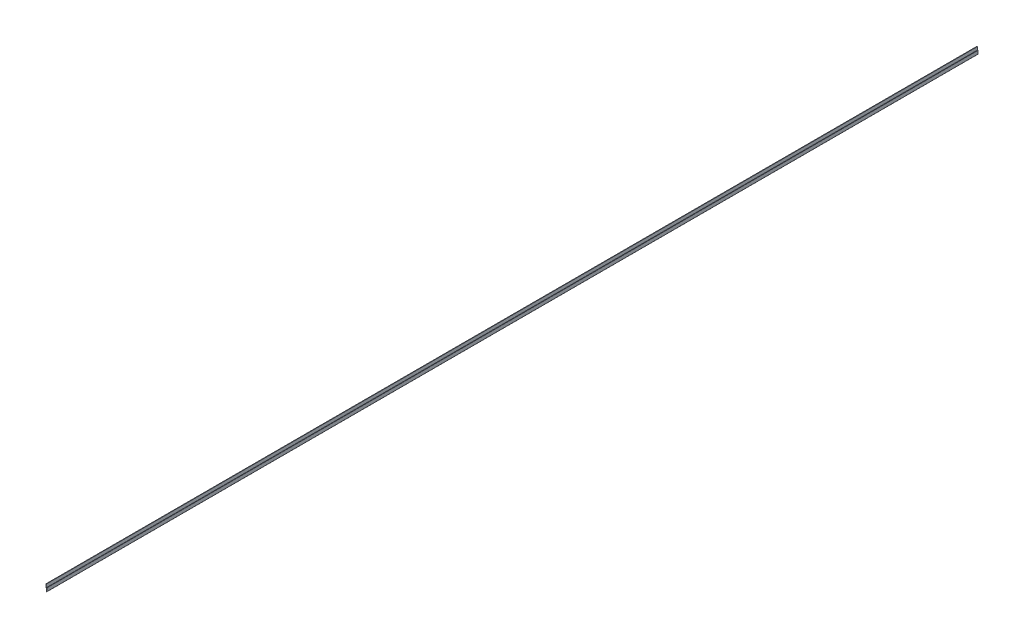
ISO-10303-21;
HEADER;
FILE_DESCRIPTION(('STEP AP214'),'2;1');
FILE_NAME('part.step','',(''),(''),'','','');
FILE_SCHEMA(('AUTOMOTIVE_DESIGN { 1 0 10303 214 1 1 1 1 }'));
ENDSEC;
DATA;
#1=APPLICATION_CONTEXT('core data for automotive mechanical design processes');
#2=APPLICATION_PROTOCOL_DEFINITION('international standard','automotive_design',2000,#1);
#3=PRODUCT_CONTEXT('',#1,'mechanical');
#4=PRODUCT('Part','Part','',(#3));
#5=PRODUCT_RELATED_PRODUCT_CATEGORY('part','',(#4));
#6=PRODUCT_DEFINITION_FORMATION('','',#4);
#7=PRODUCT_DEFINITION_CONTEXT('part definition',#1,'design');
#8=PRODUCT_DEFINITION('design','',#6,#7);
#9=PRODUCT_DEFINITION_SHAPE('','',#8);
#10=(LENGTH_UNIT() NAMED_UNIT(*) SI_UNIT(.MILLI.,.METRE.));
#11=(NAMED_UNIT(*) PLANE_ANGLE_UNIT() SI_UNIT($,.RADIAN.));
#12=(NAMED_UNIT(*) SI_UNIT($,.STERADIAN.) SOLID_ANGLE_UNIT());
#13=UNCERTAINTY_MEASURE_WITH_UNIT(LENGTH_MEASURE(1.E-05),#10,'distance_accuracy_value','');
#14=(GEOMETRIC_REPRESENTATION_CONTEXT(3) GLOBAL_UNCERTAINTY_ASSIGNED_CONTEXT((#13)) GLOBAL_UNIT_ASSIGNED_CONTEXT((#10,
#11,#12)) REPRESENTATION_CONTEXT('',''));
#15=CARTESIAN_POINT('',(0.,0.,0.));
#16=DIRECTION('',(0.,0.,1.));
#17=DIRECTION('',(1.,0.,0.));
#18=AXIS2_PLACEMENT_3D('',#15,#16,#17);
#19=CARTESIAN_POINT('',(1.34133828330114,12.0752362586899,3048.));
#20=DIRECTION('',(0.997564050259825,-0.0697564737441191,0.));
#21=DIRECTION('',(0.0697564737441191,0.997564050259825,0.));
#22=AXIS2_PLACEMENT_3D('',#19,#20,#21);
#23=PLANE('',#22);
#24=DIRECTION('',(-0.0697564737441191,-0.997564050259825,0.));
#25=VECTOR('',#24,1.);
#26=CARTESIAN_POINT('',(1.34133828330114,12.0752362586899,0.));
#27=LINE('',#26,#25);
#28=CARTESIAN_POINT('',(1.34133828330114,12.0752362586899,0.));
#29=VERTEX_POINT('',#28);
#30=CARTESIAN_POINT('',(0.72119077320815,3.20671368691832,0.));
#31=VERTEX_POINT('',#30);
#32=EDGE_CURVE('E188',#29,#31,#27,.T.);
#33=ORIENTED_EDGE('',*,*,#32,.T.);
#34=DIRECTION('',(0.,0.,-1.));
#35=VECTOR('',#34,1.);
#36=CARTESIAN_POINT('',(0.72119077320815,3.20671368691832,3048.));
#37=LINE('',#36,#35);
#38=CARTESIAN_POINT('',(0.72119077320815,3.20671368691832,3048.));
#39=VERTEX_POINT('',#38);
#40=EDGE_CURVE('E13',#39,#31,#37,.T.);
#41=ORIENTED_EDGE('',*,*,#40,.F.);
#42=DIRECTION('',(-0.0697564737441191,-0.997564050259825,0.));
#43=VECTOR('',#42,1.);
#44=CARTESIAN_POINT('',(1.34133828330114,12.0752362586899,3048.));
#45=LINE('',#44,#43);
#46=CARTESIAN_POINT('',(1.34133828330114,12.0752362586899,3048.));
#47=VERTEX_POINT('',#46);
#48=EDGE_CURVE('E125',#47,#39,#45,.T.);
#49=ORIENTED_EDGE('',*,*,#48,.F.);
#50=DIRECTION('',(0.,0.,-1.));
#51=VECTOR('',#50,1.);
#52=CARTESIAN_POINT('',(1.34133828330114,12.0752362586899,3048.));
#53=LINE('',#52,#51);
#54=EDGE_CURVE('E184',#47,#29,#53,.T.);
#55=ORIENTED_EDGE('',*,*,#54,.T.);
#56=EDGE_LOOP('',(#33,#41,#49,#55));
#57=FACE_BOUND('',#56,.T.);
#58=ADVANCED_FACE('F45',(#57),#23,.F.);
#59=CARTESIAN_POINT('',(1.22795331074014,3.17127739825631,3048.));
#60=DIRECTION('',(-0.0697564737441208,-0.997564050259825,0.));
#61=DIRECTION('',(0.997564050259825,-0.0697564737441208,0.));
#62=AXIS2_PLACEMENT_3D('',#59,#60,#61);
#63=PLANE('',#62);
#64=DIRECTION('',(-0.997564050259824,0.0697564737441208,0.));
#65=VECTOR('',#64,1.);
#66=CARTESIAN_POINT('',(1.22795331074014,3.17127739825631,0.));
#67=LINE('',#66,#65);
#68=CARTESIAN_POINT('',(1.22795331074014,3.17127739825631,0.));
#69=VERTEX_POINT('',#68);
#70=EDGE_CURVE('E191',#69,#31,#67,.T.);
#71=ORIENTED_EDGE('',*,*,#70,.F.);
#72=DIRECTION('',(0.,0.,-1.));
#73=VECTOR('',#72,1.);
#74=CARTESIAN_POINT('',(1.22795331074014,3.17127739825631,3048.));
#75=LINE('',#74,#73);
#76=CARTESIAN_POINT('',(1.22795331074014,3.17127739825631,3048.));
#77=VERTEX_POINT('',#76);
#78=EDGE_CURVE('E53',#77,#69,#75,.T.);
#79=ORIENTED_EDGE('',*,*,#78,.F.);
#80=DIRECTION('',(-0.997564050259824,0.0697564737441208,0.));
#81=VECTOR('',#80,1.);
#82=CARTESIAN_POINT('',(1.22795331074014,3.17127739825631,3048.));
#83=LINE('',#82,#81);
#84=EDGE_CURVE('E273',#77,#39,#83,.T.);
#85=ORIENTED_EDGE('',*,*,#84,.T.);
#86=ORIENTED_EDGE('',*,*,#40,.T.);
#87=EDGE_LOOP('',(#71,#79,#85,#86));
#88=FACE_BOUND('',#87,.T.);
#89=ADVANCED_FACE('F260',(#88),#63,.T.);
#90=CARTESIAN_POINT('',(1.84810082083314,12.0397999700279,3048.));
#91=DIRECTION('',(0.997564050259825,-0.0697564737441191,0.));
#92=DIRECTION('',(0.0697564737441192,0.997564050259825,0.));
#93=AXIS2_PLACEMENT_3D('',#90,#91,#92);
#94=PLANE('',#93);
#95=DIRECTION('',(-0.0697564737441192,-0.997564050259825,0.));
#96=VECTOR('',#95,1.);
#97=CARTESIAN_POINT('',(1.84810082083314,12.0397999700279,0.));
#98=LINE('',#97,#96);
#99=CARTESIAN_POINT('',(1.84810082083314,12.0397999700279,0.));
#100=VERTEX_POINT('',#99);
#101=EDGE_CURVE('E194',#100,#69,#98,.T.);
#102=ORIENTED_EDGE('',*,*,#101,.F.);
#103=DIRECTION('',(0.,0.,-1.));
#104=VECTOR('',#103,1.);
#105=CARTESIAN_POINT('',(1.84810082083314,12.0397999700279,3048.));
#106=LINE('',#105,#104);
#107=CARTESIAN_POINT('',(1.84810082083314,12.0397999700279,3048.));
#108=VERTEX_POINT('',#107);
#109=EDGE_CURVE('E250',#108,#100,#106,.T.);
#110=ORIENTED_EDGE('',*,*,#109,.F.);
#111=DIRECTION('',(-0.0697564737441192,-0.997564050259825,0.));
#112=VECTOR('',#111,1.);
#113=CARTESIAN_POINT('',(1.84810082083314,12.0397999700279,3048.));
#114=LINE('',#113,#112);
#115=EDGE_CURVE('E257',#108,#77,#114,.T.);
#116=ORIENTED_EDGE('',*,*,#115,.T.);
#117=ORIENTED_EDGE('',*,*,#78,.T.);
#118=EDGE_LOOP('',(#102,#110,#116,#117));
#119=FACE_BOUND('',#118,.T.);
#120=ADVANCED_FACE('F255',(#119),#94,.T.);
#121=CARTESIAN_POINT('',(1.97479145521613,12.0309408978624,3048.));
#122=DIRECTION('',(0.,0.,-1.));
#123=DIRECTION('',(-1.,0.,0.));
#124=AXIS2_PLACEMENT_3D('',#121,#122,#123);
#125=CYLINDRICAL_SURFACE('',#124,0.127);
#126=CARTESIAN_POINT('',(1.97479145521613,12.0309408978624,0.));
#127=DIRECTION('',(0.,0.,1.));
#128=DIRECTION('',(1.,0.,0.));
#129=AXIS2_PLACEMENT_3D('',#126,#127,#128);
#130=CIRCLE('',#129,0.127);
#131=CARTESIAN_POINT('',(2.10161740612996,12.0242942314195,0.));
#132=VERTEX_POINT('',#131);
#133=EDGE_CURVE('E197',#132,#100,#130,.T.);
#134=ORIENTED_EDGE('',*,*,#133,.F.);
#135=DIRECTION('',(0.,0.,-1.));
#136=VECTOR('',#135,1.);
#137=CARTESIAN_POINT('',(2.10161740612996,12.0242942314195,3048.));
#138=LINE('',#137,#136);
#139=CARTESIAN_POINT('',(2.10161740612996,12.0242942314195,3048.));
#140=VERTEX_POINT('',#139);
#141=EDGE_CURVE('E248',#140,#132,#138,.T.);
#142=ORIENTED_EDGE('',*,*,#141,.F.);
#143=CARTESIAN_POINT('',(1.97479145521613,12.0309408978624,3048.));
#144=DIRECTION('',(0.,0.,1.));
#145=DIRECTION('',(1.,0.,0.));
#146=AXIS2_PLACEMENT_3D('',#143,#144,#145);
#147=CIRCLE('',#146,0.127);
#148=EDGE_CURVE('E270',#140,#108,#147,.T.);
#149=ORIENTED_EDGE('',*,*,#148,.T.);
#150=ORIENTED_EDGE('',*,*,#109,.T.);
#151=EDGE_LOOP('',(#134,#142,#149,#150));
#152=FACE_BOUND('',#151,.T.);
#153=ADVANCED_FACE('F267',(#152),#125,.F.);
#154=CARTESIAN_POINT('',(1.52330380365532,0.989413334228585,3048.));
#155=DIRECTION('',(-0.998629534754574,0.0523359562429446,0.));
#156=DIRECTION('',(-0.0523359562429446,-0.998629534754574,0.));
#157=AXIS2_PLACEMENT_3D('',#154,#155,#156);
#158=PLANE('',#157);
#159=DIRECTION('',(0.0523359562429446,0.998629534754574,0.));
#160=VECTOR('',#159,1.);
#161=CARTESIAN_POINT('',(1.52330380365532,0.989413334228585,0.));
#162=LINE('',#161,#160);
#163=CARTESIAN_POINT('',(1.52330380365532,0.989413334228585,0.));
#164=VERTEX_POINT('',#163);
#165=EDGE_CURVE('E200',#164,#132,#162,.T.);
#166=ORIENTED_EDGE('',*,*,#165,.F.);
#167=DIRECTION('',(0.,0.,-1.));
#168=VECTOR('',#167,1.);
#169=CARTESIAN_POINT('',(1.52330380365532,0.989413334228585,3048.));
#170=LINE('',#169,#168);
#171=CARTESIAN_POINT('',(1.52330380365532,0.989413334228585,3048.));
#172=VERTEX_POINT('',#171);
#173=EDGE_CURVE('E246',#172,#164,#170,.T.);
#174=ORIENTED_EDGE('',*,*,#173,.F.);
#175=DIRECTION('',(0.0523359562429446,0.998629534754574,0.));
#176=VECTOR('',#175,1.);
#177=CARTESIAN_POINT('',(1.52330380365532,0.989413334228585,3048.));
#178=LINE('',#177,#176);
#179=EDGE_CURVE('E275',#172,#140,#178,.T.);
#180=ORIENTED_EDGE('',*,*,#179,.T.);
#181=ORIENTED_EDGE('',*,*,#141,.T.);
#182=EDGE_LOOP('',(#166,#174,#180,#181));
#183=FACE_BOUND('',#182,.T.);
#184=ADVANCED_FACE('F332',(#183),#158,.T.);
#185=CARTESIAN_POINT('',(1.016,1.016,3048.));
#186=DIRECTION('',(0.,0.,-1.));
#187=DIRECTION('',(-1.,0.,0.));
#188=AXIS2_PLACEMENT_3D('',#185,#186,#187);
#189=CYLINDRICAL_SURFACE('',#188,0.508);
#190=CARTESIAN_POINT('',(1.016,1.016,0.));
#191=DIRECTION('',(0.,0.,1.));
#192=DIRECTION('',(1.,0.,0.));
#193=AXIS2_PLACEMENT_3D('',#190,#191,#192);
#194=CIRCLE('',#193,0.508);
#195=CARTESIAN_POINT('',(0.508,1.016,0.));
#196=VERTEX_POINT('',#195);
#197=EDGE_CURVE('E203',#196,#164,#194,.T.);
#198=ORIENTED_EDGE('',*,*,#197,.F.);
#199=DIRECTION('',(0.,0.,-1.));
#200=VECTOR('',#199,1.);
#201=CARTESIAN_POINT('',(0.508,1.016,3048.));
#202=LINE('',#201,#200);
#203=CARTESIAN_POINT('',(0.508,1.016,3048.));
#204=VERTEX_POINT('',#203);
#205=EDGE_CURVE('E244',#204,#196,#202,.T.);
#206=ORIENTED_EDGE('',*,*,#205,.F.);
#207=CARTESIAN_POINT('',(1.016,1.016,3048.));
#208=DIRECTION('',(0.,0.,1.));
#209=DIRECTION('',(1.,0.,0.));
#210=AXIS2_PLACEMENT_3D('',#207,#208,#209);
#211=CIRCLE('',#210,0.508);
#212=EDGE_CURVE('E281',#204,#172,#211,.T.);
#213=ORIENTED_EDGE('',*,*,#212,.T.);
#214=ORIENTED_EDGE('',*,*,#173,.T.);
#215=EDGE_LOOP('',(#198,#206,#213,#214));
#216=FACE_BOUND('',#215,.T.);
#217=ADVANCED_FACE('F335',(#216),#189,.F.);
#218=CARTESIAN_POINT('',(0.508,1.016,3048.));
#219=DIRECTION('',(1.,0.,0.));
#220=DIRECTION('',(0.,1.,0.));
#221=AXIS2_PLACEMENT_3D('',#218,#219,#220);
#222=PLANE('',#221);
#223=DIRECTION('',(0.,-1.,0.));
#224=VECTOR('',#223,1.);
#225=CARTESIAN_POINT('',(0.508,1.016,0.));
#226=LINE('',#225,#224);
#227=CARTESIAN_POINT('',(0.508000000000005,21.5900159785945,0.));
#228=VERTEX_POINT('',#227);
#229=EDGE_CURVE('E206',#228,#196,#226,.T.);
#230=ORIENTED_EDGE('',*,*,#229,.F.);
#231=DIRECTION('',(0.,0.,-1.));
#232=VECTOR('',#231,1.);
#233=CARTESIAN_POINT('',(0.508000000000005,21.5900159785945,3048.));
#234=LINE('',#233,#232);
#235=CARTESIAN_POINT('',(0.508000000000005,21.5900159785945,3048.));
#236=VERTEX_POINT('',#235);
#237=EDGE_CURVE('E242',#236,#228,#234,.T.);
#238=ORIENTED_EDGE('',*,*,#237,.F.);
#239=DIRECTION('',(0.,-1.,0.));
#240=VECTOR('',#239,1.);
#241=CARTESIAN_POINT('',(0.508,1.016,3048.));
#242=LINE('',#241,#240);
#243=EDGE_CURVE('E284',#236,#204,#242,.T.);
#244=ORIENTED_EDGE('',*,*,#243,.T.);
#245=ORIENTED_EDGE('',*,*,#205,.T.);
#246=EDGE_LOOP('',(#230,#238,#244,#245));
#247=FACE_BOUND('',#246,.T.);
#248=ADVANCED_FACE('F339',(#247),#222,.T.);
#249=CARTESIAN_POINT('',(-0.126999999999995,21.5900159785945,3048.));
#250=DIRECTION('',(0.,0.,-1.));
#251=DIRECTION('',(-1.,0.,0.));
#252=AXIS2_PLACEMENT_3D('',#249,#250,#251);
#253=CYLINDRICAL_SURFACE('',#252,0.635);
#254=CARTESIAN_POINT('',(-0.126999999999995,21.5900159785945,0.));
#255=DIRECTION('',(0.,0.,1.));
#256=DIRECTION('',(1.,0.,0.));
#257=AXIS2_PLACEMENT_3D('',#254,#255,#256);
#258=CIRCLE('',#257,0.635);
#259=CARTESIAN_POINT('',(-0.761680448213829,21.6101586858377,0.));
#260=VERTEX_POINT('',#259);
#261=EDGE_CURVE('E209',#260,#228,#258,.F.);
#262=ORIENTED_EDGE('',*,*,#261,.F.);
#263=DIRECTION('',(0.,0.,-1.));
#264=VECTOR('',#263,1.);
#265=CARTESIAN_POINT('',(-0.761680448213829,21.6101586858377,3048.));
#266=LINE('',#265,#264);
#267=CARTESIAN_POINT('',(-0.761680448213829,21.6101586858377,3048.));
#268=VERTEX_POINT('',#267);
#269=EDGE_CURVE('E240',#268,#260,#266,.T.);
#270=ORIENTED_EDGE('',*,*,#269,.F.);
#271=CARTESIAN_POINT('',(-0.126999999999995,21.5900159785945,3048.));
#272=DIRECTION('',(0.,0.,1.));
#273=DIRECTION('',(1.,0.,0.));
#274=AXIS2_PLACEMENT_3D('',#271,#272,#273);
#275=CIRCLE('',#274,0.635);
#276=EDGE_CURVE('E287',#268,#236,#275,.F.);
#277=ORIENTED_EDGE('',*,*,#276,.T.);
#278=ORIENTED_EDGE('',*,*,#237,.T.);
#279=EDGE_LOOP('',(#262,#270,#277,#278));
#280=FACE_BOUND('',#279,.T.);
#281=ADVANCED_FACE('F343',(#280),#253,.T.);
#282=CARTESIAN_POINT('',(-0.761680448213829,21.6101586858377,3048.));
#283=DIRECTION('',(-0.999496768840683,0.031720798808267,0.));
#284=DIRECTION('',(-0.031720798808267,-0.999496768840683,0.));
#285=AXIS2_PLACEMENT_3D('',#282,#283,#284);
#286=PLANE('',#285);
#287=DIRECTION('',(0.031720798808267,0.999496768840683,0.));
#288=VECTOR('',#287,1.);
#289=CARTESIAN_POINT('',(-0.761680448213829,21.6101586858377,0.));
#290=LINE('',#289,#288);
#291=CARTESIAN_POINT('',(-1.14439239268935,9.55121419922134,0.));
#292=VERTEX_POINT('',#291);
#293=EDGE_CURVE('E212',#292,#260,#290,.T.);
#294=ORIENTED_EDGE('',*,*,#293,.F.);
#295=DIRECTION('',(0.,0.,-1.));
#296=VECTOR('',#295,1.);
#297=CARTESIAN_POINT('',(-1.14439239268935,9.55121419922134,3048.));
#298=LINE('',#297,#296);
#299=CARTESIAN_POINT('',(-1.14439239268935,9.55121419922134,3048.));
#300=VERTEX_POINT('',#299);
#301=EDGE_CURVE('E238',#300,#292,#298,.T.);
#302=ORIENTED_EDGE('',*,*,#301,.F.);
#303=DIRECTION('',(0.031720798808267,0.999496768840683,0.));
#304=VECTOR('',#303,1.);
#305=CARTESIAN_POINT('',(-0.761680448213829,21.6101586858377,3048.));
#306=LINE('',#305,#304);
#307=EDGE_CURVE('E290',#300,#268,#306,.T.);
#308=ORIENTED_EDGE('',*,*,#307,.T.);
#309=ORIENTED_EDGE('',*,*,#269,.T.);
#310=EDGE_LOOP('',(#294,#302,#308,#309));
#311=FACE_BOUND('',#310,.T.);
#312=ADVANCED_FACE('F347',(#311),#286,.T.);
#313=CARTESIAN_POINT('',(-0.636648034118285,9.53510003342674,3048.));
#314=DIRECTION('',(-0.031720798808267,-0.999496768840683,0.));
#315=DIRECTION('',(0.999496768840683,-0.031720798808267,0.));
#316=AXIS2_PLACEMENT_3D('',#313,#314,#315);
#317=PLANE('',#316);
#318=DIRECTION('',(-0.999496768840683,0.031720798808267,0.));
#319=VECTOR('',#318,1.);
#320=CARTESIAN_POINT('',(-0.636648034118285,9.53510003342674,0.));
#321=LINE('',#320,#319);
#322=CARTESIAN_POINT('',(-0.636648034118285,9.53510003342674,0.));
#323=VERTEX_POINT('',#322);
#324=EDGE_CURVE('E215',#323,#292,#321,.T.);
#325=ORIENTED_EDGE('',*,*,#324,.F.);
#326=DIRECTION('',(0.,0.,-1.));
#327=VECTOR('',#326,1.);
#328=CARTESIAN_POINT('',(-0.636648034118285,9.53510003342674,3048.));
#329=LINE('',#328,#327);
#330=CARTESIAN_POINT('',(-0.636648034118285,9.53510003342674,3048.));
#331=VERTEX_POINT('',#330);
#332=EDGE_CURVE('E236',#331,#323,#329,.T.);
#333=ORIENTED_EDGE('',*,*,#332,.F.);
#334=DIRECTION('',(-0.999496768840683,0.031720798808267,0.));
#335=VECTOR('',#334,1.);
#336=CARTESIAN_POINT('',(-0.636648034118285,9.53510003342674,3048.));
#337=LINE('',#336,#335);
#338=EDGE_CURVE('E293',#331,#300,#337,.T.);
#339=ORIENTED_EDGE('',*,*,#338,.T.);
#340=ORIENTED_EDGE('',*,*,#301,.T.);
#341=EDGE_LOOP('',(#325,#333,#339,#340));
#342=FACE_BOUND('',#341,.T.);
#343=ADVANCED_FACE('F351',(#342),#317,.T.);
#344=CARTESIAN_POINT('',(-0.253936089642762,21.5940445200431,3048.));
#345=DIRECTION('',(-0.999496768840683,0.031720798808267,0.));
#346=DIRECTION('',(-0.0317207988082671,-0.999496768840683,0.));
#347=AXIS2_PLACEMENT_3D('',#344,#345,#346);
#348=PLANE('',#347);
#349=DIRECTION('',(0.031720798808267,0.999496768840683,0.));
#350=VECTOR('',#349,1.);
#351=CARTESIAN_POINT('',(-0.253936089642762,21.5940445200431,0.));
#352=LINE('',#351,#350);
#353=CARTESIAN_POINT('',(-0.253936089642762,21.5940445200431,0.));
#354=VERTEX_POINT('',#353);
#355=EDGE_CURVE('E218',#323,#354,#352,.T.);
#356=ORIENTED_EDGE('',*,*,#355,.T.);
#357=DIRECTION('',(0.,0.,-1.));
#358=VECTOR('',#357,1.);
#359=CARTESIAN_POINT('',(-0.253936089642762,21.5940445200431,3048.));
#360=LINE('',#359,#358);
#361=CARTESIAN_POINT('',(-0.253936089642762,21.5940445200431,3048.));
#362=VERTEX_POINT('',#361);
#363=EDGE_CURVE('E233',#362,#354,#360,.T.);
#364=ORIENTED_EDGE('',*,*,#363,.F.);
#365=DIRECTION('',(0.031720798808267,0.999496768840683,0.));
#366=VECTOR('',#365,1.);
#367=CARTESIAN_POINT('',(-0.253936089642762,21.5940445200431,3048.));
#368=LINE('',#367,#366);
#369=EDGE_CURVE('E296',#331,#362,#368,.T.);
#370=ORIENTED_EDGE('',*,*,#369,.F.);
#371=ORIENTED_EDGE('',*,*,#332,.T.);
#372=EDGE_LOOP('',(#356,#364,#370,#371));
#373=FACE_BOUND('',#372,.T.);
#374=ADVANCED_FACE('F355',(#373),#348,.F.);
#375=CARTESIAN_POINT('',(-0.126999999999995,21.5900159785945,3048.));
#376=DIRECTION('',(0.,0.,-1.));
#377=DIRECTION('',(-1.,0.,0.));
#378=AXIS2_PLACEMENT_3D('',#375,#376,#377);
#379=CYLINDRICAL_SURFACE('',#378,0.127);
#380=CARTESIAN_POINT('',(-0.126999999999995,21.5900159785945,0.));
#381=DIRECTION('',(0.,0.,-1.));
#382=DIRECTION('',(1.,0.,0.));
#383=AXIS2_PLACEMENT_3D('',#380,#381,#382);
#384=CIRCLE('',#383,0.127);
#385=CARTESIAN_POINT('',(0.,21.5900159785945,0.));
#386=VERTEX_POINT('',#385);
#387=EDGE_CURVE('E220',#354,#386,#384,.T.);
#388=ORIENTED_EDGE('',*,*,#387,.T.);
#389=DIRECTION('',(0.,0.,-1.));
#390=VECTOR('',#389,1.);
#391=CARTESIAN_POINT('',(0.,21.5900159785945,3048.));
#392=LINE('',#391,#390);
#393=CARTESIAN_POINT('',(0.,21.5900159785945,3048.));
#394=VERTEX_POINT('',#393);
#395=EDGE_CURVE('E230',#394,#386,#392,.T.);
#396=ORIENTED_EDGE('',*,*,#395,.F.);
#397=CARTESIAN_POINT('',(-0.126999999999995,21.5900159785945,3048.));
#398=DIRECTION('',(0.,0.,-1.));
#399=DIRECTION('',(1.,0.,0.));
#400=AXIS2_PLACEMENT_3D('',#397,#398,#399);
#401=CIRCLE('',#400,0.127);
#402=EDGE_CURVE('E298',#362,#394,#401,.T.);
#403=ORIENTED_EDGE('',*,*,#402,.F.);
#404=ORIENTED_EDGE('',*,*,#363,.T.);
#405=EDGE_LOOP('',(#388,#396,#403,#404));
#406=FACE_BOUND('',#405,.T.);
#407=ADVANCED_FACE('F305',(#406),#379,.F.);
#408=CARTESIAN_POINT('',(0.,1.016,3048.));
#409=DIRECTION('',(1.,0.,0.));
#410=DIRECTION('',(0.,1.,0.));
#411=AXIS2_PLACEMENT_3D('',#408,#409,#410);
#412=PLANE('',#411);
#413=DIRECTION('',(0.,-1.,0.));
#414=VECTOR('',#413,1.);
#415=CARTESIAN_POINT('',(0.,1.016,0.));
#416=LINE('',#415,#414);
#417=CARTESIAN_POINT('',(0.,1.016,0.));
#418=VERTEX_POINT('',#417);
#419=EDGE_CURVE('E222',#386,#418,#416,.T.);
#420=ORIENTED_EDGE('',*,*,#419,.T.);
#421=DIRECTION('',(0.,0.,-1.));
#422=VECTOR('',#421,1.);
#423=CARTESIAN_POINT('',(0.,1.016,3048.));
#424=LINE('',#423,#422);
#425=CARTESIAN_POINT('',(0.,1.016,3048.));
#426=VERTEX_POINT('',#425);
#427=EDGE_CURVE('E179',#426,#418,#424,.T.);
#428=ORIENTED_EDGE('',*,*,#427,.F.);
#429=DIRECTION('',(0.,-1.,0.));
#430=VECTOR('',#429,1.);
#431=CARTESIAN_POINT('',(0.,1.016,3048.));
#432=LINE('',#431,#430);
#433=EDGE_CURVE('E170',#394,#426,#432,.T.);
#434=ORIENTED_EDGE('',*,*,#433,.F.);
#435=ORIENTED_EDGE('',*,*,#395,.T.);
#436=EDGE_LOOP('',(#420,#428,#434,#435));
#437=FACE_BOUND('',#436,.T.);
#438=ADVANCED_FACE('F309',(#437),#412,.F.);
#439=CARTESIAN_POINT('',(1.016,1.016,3048.));
#440=DIRECTION('',(0.,0.,-1.));
#441=DIRECTION('',(-1.,0.,0.));
#442=AXIS2_PLACEMENT_3D('',#439,#440,#441);
#443=CYLINDRICAL_SURFACE('',#442,1.016);
#444=CARTESIAN_POINT('',(1.016,1.016,0.));
#445=DIRECTION('',(0.,0.,1.));
#446=DIRECTION('',(1.,0.,0.));
#447=AXIS2_PLACEMENT_3D('',#444,#445,#446);
#448=CIRCLE('',#447,1.016);
#449=CARTESIAN_POINT('',(2.03060760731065,0.962826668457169,0.));
#450=VERTEX_POINT('',#449);
#451=EDGE_CURVE('E178',#418,#450,#448,.T.);
#452=ORIENTED_EDGE('',*,*,#451,.T.);
#453=DIRECTION('',(0.,0.,-1.));
#454=VECTOR('',#453,1.);
#455=CARTESIAN_POINT('',(2.03060760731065,0.962826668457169,3048.));
#456=LINE('',#455,#454);
#457=CARTESIAN_POINT('',(2.03060760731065,0.962826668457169,3048.));
#458=VERTEX_POINT('',#457);
#459=EDGE_CURVE('E175',#458,#450,#456,.T.);
#460=ORIENTED_EDGE('',*,*,#459,.F.);
#461=CARTESIAN_POINT('',(1.016,1.016,3048.));
#462=DIRECTION('',(0.,0.,1.));
#463=DIRECTION('',(1.,0.,0.));
#464=AXIS2_PLACEMENT_3D('',#461,#462,#463);
#465=CIRCLE('',#464,1.016);
#466=EDGE_CURVE('E164',#426,#458,#465,.T.);
#467=ORIENTED_EDGE('',*,*,#466,.F.);
#468=ORIENTED_EDGE('',*,*,#427,.T.);
#469=EDGE_LOOP('',(#452,#460,#467,#468));
#470=FACE_BOUND('',#469,.T.);
#471=ADVANCED_FACE('F176',(#470),#443,.T.);
#472=CARTESIAN_POINT('',(2.03060760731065,0.962826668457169,3048.));
#473=DIRECTION('',(-0.998629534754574,0.0523359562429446,0.));
#474=DIRECTION('',(-0.0523359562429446,-0.998629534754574,0.));
#475=AXIS2_PLACEMENT_3D('',#472,#473,#474);
#476=PLANE('',#475);
#477=DIRECTION('',(0.0523359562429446,0.998629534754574,0.));
#478=VECTOR('',#477,1.);
#479=CARTESIAN_POINT('',(2.03060760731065,0.962826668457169,0.));
#480=LINE('',#479,#478);
#481=CARTESIAN_POINT('',(2.60892120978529,11.9977075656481,0.));
#482=VERTEX_POINT('',#481);
#483=EDGE_CURVE('E113',#450,#482,#480,.T.);
#484=ORIENTED_EDGE('',*,*,#483,.T.);
#485=DIRECTION('',(0.,0.,-1.));
#486=VECTOR('',#485,1.);
#487=CARTESIAN_POINT('',(2.60892120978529,11.9977075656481,3048.));
#488=LINE('',#487,#486);
#489=CARTESIAN_POINT('',(2.60892120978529,11.9977075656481,3048.));
#490=VERTEX_POINT('',#489);
#491=EDGE_CURVE('E180',#490,#482,#488,.T.);
#492=ORIENTED_EDGE('',*,*,#491,.F.);
#493=DIRECTION('',(0.0523359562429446,0.998629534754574,0.));
#494=VECTOR('',#493,1.);
#495=CARTESIAN_POINT('',(2.03060760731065,0.962826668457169,3048.));
#496=LINE('',#495,#494);
#497=EDGE_CURVE('E168',#458,#490,#496,.T.);
#498=ORIENTED_EDGE('',*,*,#497,.F.);
#499=ORIENTED_EDGE('',*,*,#459,.T.);
#500=EDGE_LOOP('',(#484,#492,#498,#499));
#501=FACE_BOUND('',#500,.T.);
#502=ADVANCED_FACE('F182',(#501),#476,.F.);
#503=CARTESIAN_POINT('',(1.97479145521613,12.0309408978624,3048.));
#504=DIRECTION('',(0.,0.,-1.));
#505=DIRECTION('',(-1.,0.,0.));
#506=AXIS2_PLACEMENT_3D('',#503,#504,#505);
#507=CYLINDRICAL_SURFACE('',#506,0.635);
#508=CARTESIAN_POINT('',(1.97479145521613,12.0309408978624,0.));
#509=DIRECTION('',(0.,0.,1.));
#510=DIRECTION('',(1.,0.,0.));
#511=AXIS2_PLACEMENT_3D('',#508,#509,#510);
#512=CIRCLE('',#511,0.635);
#513=EDGE_CURVE('E119',#482,#29,#512,.T.);
#514=ORIENTED_EDGE('',*,*,#513,.T.);
#515=ORIENTED_EDGE('',*,*,#54,.F.);
#516=CARTESIAN_POINT('',(1.97479145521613,12.0309408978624,3048.));
#517=DIRECTION('',(0.,0.,1.));
#518=DIRECTION('',(1.,0.,0.));
#519=AXIS2_PLACEMENT_3D('',#516,#517,#518);
#520=CIRCLE('',#519,0.635);
#521=EDGE_CURVE('E61',#490,#47,#520,.T.);
#522=ORIENTED_EDGE('',*,*,#521,.F.);
#523=ORIENTED_EDGE('',*,*,#491,.T.);
#524=EDGE_LOOP('',(#514,#515,#522,#523));
#525=FACE_BOUND('',#524,.T.);
#526=ADVANCED_FACE('F311',(#525),#507,.T.);
#527=CARTESIAN_POINT('',(1.97479145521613,12.0309408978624,3048.));
#528=DIRECTION('',(0.,0.,1.));
#529=DIRECTION('',(1.,0.,0.));
#530=AXIS2_PLACEMENT_3D('',#527,#528,#529);
#531=PLANE('',#530);
#532=ORIENTED_EDGE('',*,*,#48,.T.);
#533=ORIENTED_EDGE('',*,*,#84,.F.);
#534=ORIENTED_EDGE('',*,*,#115,.F.);
#535=ORIENTED_EDGE('',*,*,#148,.F.);
#536=ORIENTED_EDGE('',*,*,#179,.F.);
#537=ORIENTED_EDGE('',*,*,#212,.F.);
#538=ORIENTED_EDGE('',*,*,#243,.F.);
#539=ORIENTED_EDGE('',*,*,#276,.F.);
#540=ORIENTED_EDGE('',*,*,#307,.F.);
#541=ORIENTED_EDGE('',*,*,#338,.F.);
#542=ORIENTED_EDGE('',*,*,#369,.T.);
#543=ORIENTED_EDGE('',*,*,#402,.T.);
#544=ORIENTED_EDGE('',*,*,#433,.T.);
#545=ORIENTED_EDGE('',*,*,#466,.T.);
#546=ORIENTED_EDGE('',*,*,#497,.T.);
#547=ORIENTED_EDGE('',*,*,#521,.T.);
#548=EDGE_LOOP('',(#532,#533,#534,#535,#536,#537,#538,#539,#540,#541,#542,#543,#544,#545,#546,#547));
#549=FACE_BOUND('',#548,.T.);
#550=ADVANCED_FACE('F166',(#549),#531,.T.);
#551=CARTESIAN_POINT('',(1.97479145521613,12.0309408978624,0.));
#552=DIRECTION('',(0.,0.,1.));
#553=DIRECTION('',(1.,0.,0.));
#554=AXIS2_PLACEMENT_3D('',#551,#552,#553);
#555=PLANE('',#554);
#556=ORIENTED_EDGE('',*,*,#32,.F.);
#557=ORIENTED_EDGE('',*,*,#513,.F.);
#558=ORIENTED_EDGE('',*,*,#483,.F.);
#559=ORIENTED_EDGE('',*,*,#451,.F.);
#560=ORIENTED_EDGE('',*,*,#419,.F.);
#561=ORIENTED_EDGE('',*,*,#387,.F.);
#562=ORIENTED_EDGE('',*,*,#355,.F.);
#563=ORIENTED_EDGE('',*,*,#324,.T.);
#564=ORIENTED_EDGE('',*,*,#293,.T.);
#565=ORIENTED_EDGE('',*,*,#261,.T.);
#566=ORIENTED_EDGE('',*,*,#229,.T.);
#567=ORIENTED_EDGE('',*,*,#197,.T.);
#568=ORIENTED_EDGE('',*,*,#165,.T.);
#569=ORIENTED_EDGE('',*,*,#133,.T.);
#570=ORIENTED_EDGE('',*,*,#101,.T.);
#571=ORIENTED_EDGE('',*,*,#70,.T.);
#572=EDGE_LOOP('',(#556,#557,#558,#559,#560,#561,#562,#563,#564,#565,#566,#567,#568,#569,#570,#571));
#573=FACE_BOUND('',#572,.T.);
#574=ADVANCED_FACE('F263',(#573),#555,.F.);
#575=CLOSED_SHELL('',(#58,#89,#120,#153,#184,#217,#248,#281,#312,#343,#374,#407,#438,#471,#502,
#526,#550,#574));
#576=MANIFOLD_SOLID_BREP('B2',#575);
#577=ADVANCED_BREP_SHAPE_REPRESENTATION('',(#18,#576),#14);
#578=SHAPE_DEFINITION_REPRESENTATION(#9,#577);
ENDSEC;
END-ISO-10303-21;
